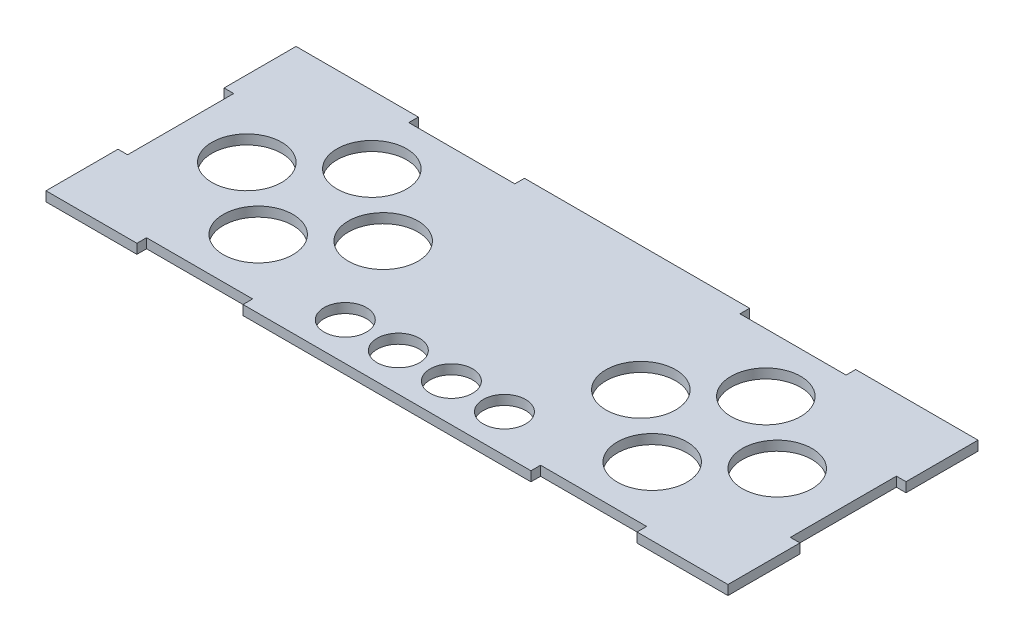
from build123d import *

# Parameters (mm, degrees)
SKETCH1_R           = 23
SKETCH1_R_2         = 14
BOSS_EXTRUDE1_DEPTH = 6.35


with BuildPart() as part:
    # Sketch1 → Boss-Extrude1 (new body)
    with BuildSketch(Plane(origin=(0, 0, 0), x_dir=(1, 0, 0), z_dir=(0, 1, 0))):
        Polygon((74.275, 82.5), (-74.275, 82.5), (-74.275, 76.15), (-144.275, 76.15), (-144.275, 82.5), (-225, 82.5), (-225, 35), (-218.65, 35), (-218.65, -35), (-225, -35), (-225, -82.5), (-165, -82.5), (-165, -76.15), (-95, -76.15), (-95, -82.5), (95, -82.5), (95, -76.15), (165, -76.15), (165, -82.5), (225, -82.5), (225, -35), (218.65, -35), (218.65, 35), (225, 35), (225, 82.5), (144.275, 82.5), (144.275, 76.15), (74.275, 76.15), align=None)
        with Locations(Location((-130, 37.5, 0), (0, 0, 270))):
            Circle(SKETCH1_R, mode=Mode.SUBTRACT)
        with Locations(Location((-85, 0, 0), (0, 0, 270))):
            Circle(SKETCH1_R, mode=Mode.SUBTRACT)
        with Locations(Location((-175, 0, 0), (0, 0, 270))):
            Circle(SKETCH1_R, mode=Mode.SUBTRACT)
        with Locations(Location((-130, -37.5, 0), (0, 0, 270))):
            Circle(SKETCH1_R, mode=Mode.SUBTRACT)
        with Locations(Location((130, 37.5, 0), (0, 0, 270))):
            Circle(SKETCH1_R, mode=Mode.SUBTRACT)
        with Locations(Location((85, 0, 0), (0, 0, 270))):
            Circle(SKETCH1_R, mode=Mode.SUBTRACT)
        with Locations(Location((175, 0, 0), (0, 0, 270))):
            Circle(SKETCH1_R, mode=Mode.SUBTRACT)
        with Locations(Location((130, -37.5, 0), (0, 0, 270))):
            Circle(SKETCH1_R, mode=Mode.SUBTRACT)
        with Locations(Location((-52.5, -57.5, 0), (0, 0, 270))):
            Circle(SKETCH1_R_2, mode=Mode.SUBTRACT)
        with Locations(Location((-17.5, -57.5, 0), (0, 0, 270))):
            Circle(SKETCH1_R_2, mode=Mode.SUBTRACT)
        with Locations(Location((17.5, -57.5, 0), (0, 0, 270))):
            Circle(SKETCH1_R_2, mode=Mode.SUBTRACT)
        with Locations(Location((52.5, -57.5, 0), (0, 0, 270))):
            Circle(SKETCH1_R_2, mode=Mode.SUBTRACT)
    extrude(amount=BOSS_EXTRUDE1_DEPTH)


solid = part.part
